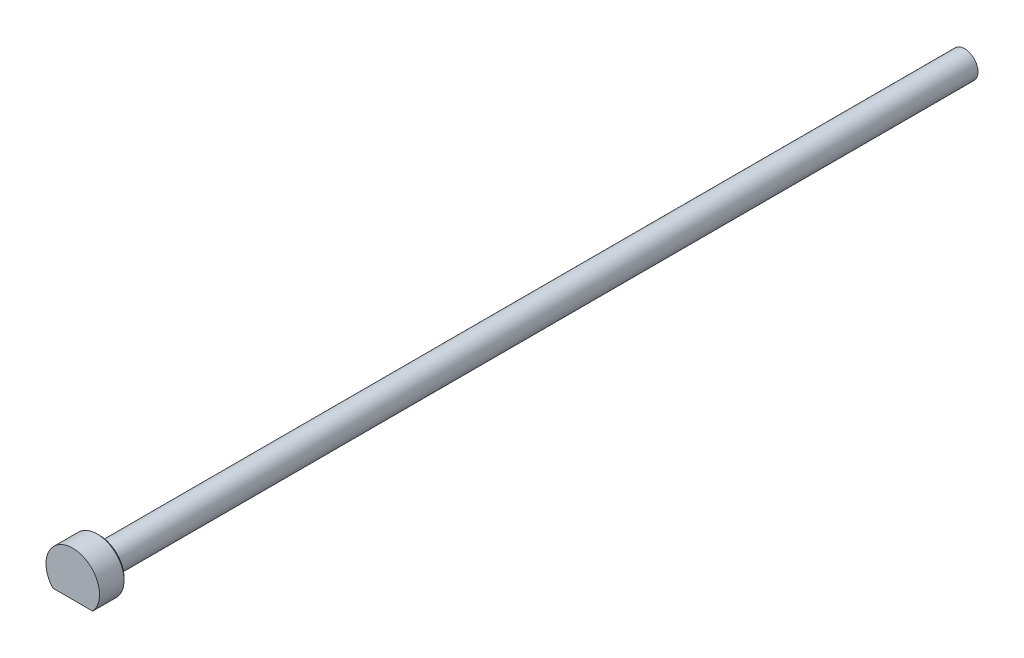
from build123d import *

# Parameters (mm, degrees)
CUT_EXTRUDE1_DEPTH      = 101.089959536
CUT_EXTRUDE1_DEPTH_BACK = 101.089959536


with BuildPart() as part:
    # Sketch1 → Revolve1 (revolve)
    with BuildSketch(Plane(origin=(0, -18, -1.35), x_dir=(0, 0, -1), z_dir=(1, 0, 0)), mode=Mode.PRIVATE) as revolve1_sk:
        with BuildLine():
            Line((-1.35, 18), (-1.35, 21))
            Line((-1.35, 21), (1.4, 21))
            Line((1.4, 21), (1.65, 20.75))
            Line((1.65, 20.75), (1.65, 19.8))
            ThreePointArc((1.65, 19.8), (1.737867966, 19.587867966), (1.95, 19.5))
            Line((1.95, 19.5), (98.65, 19.5))
            Line((98.65, 19.5), (98.65, 18))
            Line((98.65, 18), (-1.35, 18))
        make_face()
    revolve(revolve1_sk.sketch.rotate(Axis((0, 0, 0), (0, 0, 1)), 90), axis=Axis((0, 0, 0), (0, 0, 1)))

    # Sketch2 → Cut-Extrude1 (cut, two sides: drawn at the far end of the back side and taken through both)
    with BuildSketch(Plane.XY.offset(-CUT_EXTRUDE1_DEPTH_BACK)):
        Polygon((-166.470653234, -2), (-50, -2), (50, -2), (166.470653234, -2), (166.470653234, -234.941306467), (-166.470653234, -234.941306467), align=None)
    extrude(amount=CUT_EXTRUDE1_DEPTH + CUT_EXTRUDE1_DEPTH_BACK, mode=Mode.SUBTRACT)


solid = part.part
